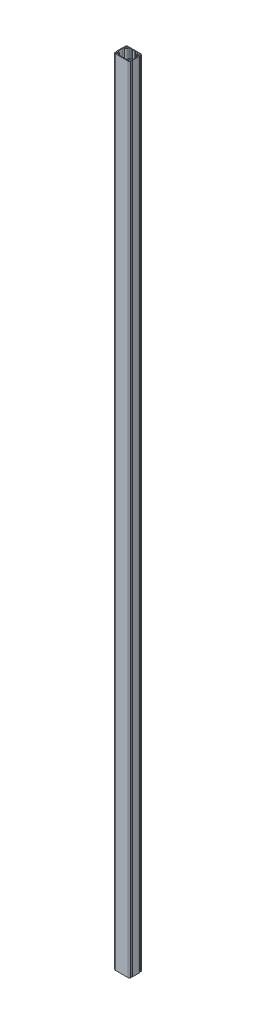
from build123d import *

# Parameters (mm, degrees)
SALIENTE_EXTRUIR1_DEPTH = 5000


with BuildPart() as part:
    # Croquis1 → Saliente-Extruir1 (new body)
    with BuildSketch(Plane(origin=(0, 0, 0), x_dir=(1, 0, 0), z_dir=(0, 1, 0))):
        with BuildLine():
            Line((39.5, -51.654327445), (-39.5, -51.654327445))
            ThreePointArc((-39.5, -51.654327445), (-45.378848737, -49.854277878), (-49.242036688, -45.071306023))
            ThreePointArc((-49.242036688, -45.071306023), (-48.132501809, -42.469588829), (-45.530784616, -43.579123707))
            ThreePointArc((-45.530784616, -43.579123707), (-33.301534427, -43.111116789), (-43.045454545, -35.706414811))
            ThreePointArc((-43.045454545, -35.706414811), (-47.645290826, -35.890503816), (-50, -31.934782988))
            Line((-50, -31.934782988), (-50, 8.626128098))
            ThreePointArc((-50, 8.626128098), (-47.645290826, 12.581848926), (-43.045454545, 12.397759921))
            ThreePointArc((-43.045454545, 12.397759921), (-33.301534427, 19.8024619), (-45.530784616, 20.270468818))
            ThreePointArc((-45.530784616, 20.270468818), (-48.132501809, 19.16093394), (-49.242036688, 21.762651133))
            ThreePointArc((-49.242036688, 21.762651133), (-45.378848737, 26.545622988), (-39.5, 28.345672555))
            Line((-39.5, 28.345672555), (39.5, 28.345672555))
            ThreePointArc((39.5, 28.345672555), (45.378848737, 26.545622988), (49.242036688, 21.762651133))
            ThreePointArc((49.242036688, 21.762651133), (48.132501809, 19.16093394), (45.530784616, 20.270468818))
            ThreePointArc((45.530784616, 20.270468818), (33.301534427, 19.8024619), (43.045454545, 12.397759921))
            ThreePointArc((43.045454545, 12.397759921), (47.645290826, 12.581848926), (50, 8.626128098))
            Line((50, 8.626128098), (50, -31.934782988))
            ThreePointArc((50, -31.934782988), (47.645290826, -35.890503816), (43.045454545, -35.706414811))
            ThreePointArc((43.045454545, -35.706414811), (33.301534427, -43.111116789), (45.530784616, -43.579123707))
            ThreePointArc((45.530784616, -43.579123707), (48.132501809, -42.469588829), (49.242036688, -45.071306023))
            ThreePointArc((49.242036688, -45.071306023), (45.378848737, -49.854277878), (39.5, -51.654327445))
        make_face()
        with BuildLine():
            Line((22.5, 24.345672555), (12.5, 24.345672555))
            Line((12.5, 24.345672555), (11, 22.845672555))
            Line((11, 22.845672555), (8, 22.845672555))
            Line((8, 22.845672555), (6.5, 24.345672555))
            Line((6.5, 24.345672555), (-6.5, 24.345672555))
            Line((-6.5, 24.345672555), (-8, 22.845672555))
            Line((-8, 22.845672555), (-11, 22.845672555))
            Line((-11, 22.845672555), (-12.5, 24.345672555))
            Line((-12.5, 24.345672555), (-22.5, 24.345672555))
            ThreePointArc((-22.5, 24.345672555), (-27.096194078, 22.441866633), (-29, 17.845672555))
            ThreePointArc((-29, 17.845672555), (-32.075378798, 10.421051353), (-39.5, 7.345672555))
            ThreePointArc((-39.5, 7.345672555), (-44.096194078, 5.441866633), (-46, 0.845672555))
            Line((-46, 0.845672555), (-46, -24.154327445))
            ThreePointArc((-46, -24.154327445), (-44.096194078, -28.750521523), (-39.5, -30.654327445))
            ThreePointArc((-39.5, -30.654327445), (-32.075378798, -33.729706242), (-29, -41.154327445))
            ThreePointArc((-29, -41.154327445), (-27.096194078, -45.750521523), (-22.5, -47.654327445))
            Line((-22.5, -47.654327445), (-12.5, -47.654327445))
            Line((-12.5, -47.654327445), (-11, -46.154327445))
            Line((-11, -46.154327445), (-8, -46.154327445))
            Line((-8, -46.154327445), (-6.5, -47.654327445))
            Line((-6.5, -47.654327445), (6.5, -47.654327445))
            Line((6.5, -47.654327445), (8, -46.154327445))
            Line((8, -46.154327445), (11, -46.154327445))
            Line((11, -46.154327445), (12.5, -47.654327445))
            Line((12.5, -47.654327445), (22.5, -47.654327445))
            ThreePointArc((22.5, -47.654327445), (27.096194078, -45.750521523), (29, -41.154327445))
            ThreePointArc((29, -41.154327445), (32.075378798, -33.729706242), (39.5, -30.654327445))
            ThreePointArc((39.5, -30.654327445), (44.096194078, -28.750521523), (46, -24.154327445))
            Line((46, -24.154327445), (46, 0.845672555))
            ThreePointArc((46, 0.845672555), (44.096194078, 5.441866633), (39.5, 7.345672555))
            ThreePointArc((39.5, 7.345672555), (32.075378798, 10.421051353), (29, 17.845672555))
            ThreePointArc((29, 17.845672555), (27.096194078, 22.441866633), (22.5, 24.345672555))
        make_face(mode=Mode.SUBTRACT)
    extrude(amount=SALIENTE_EXTRUIR1_DEPTH)


solid = part.part
